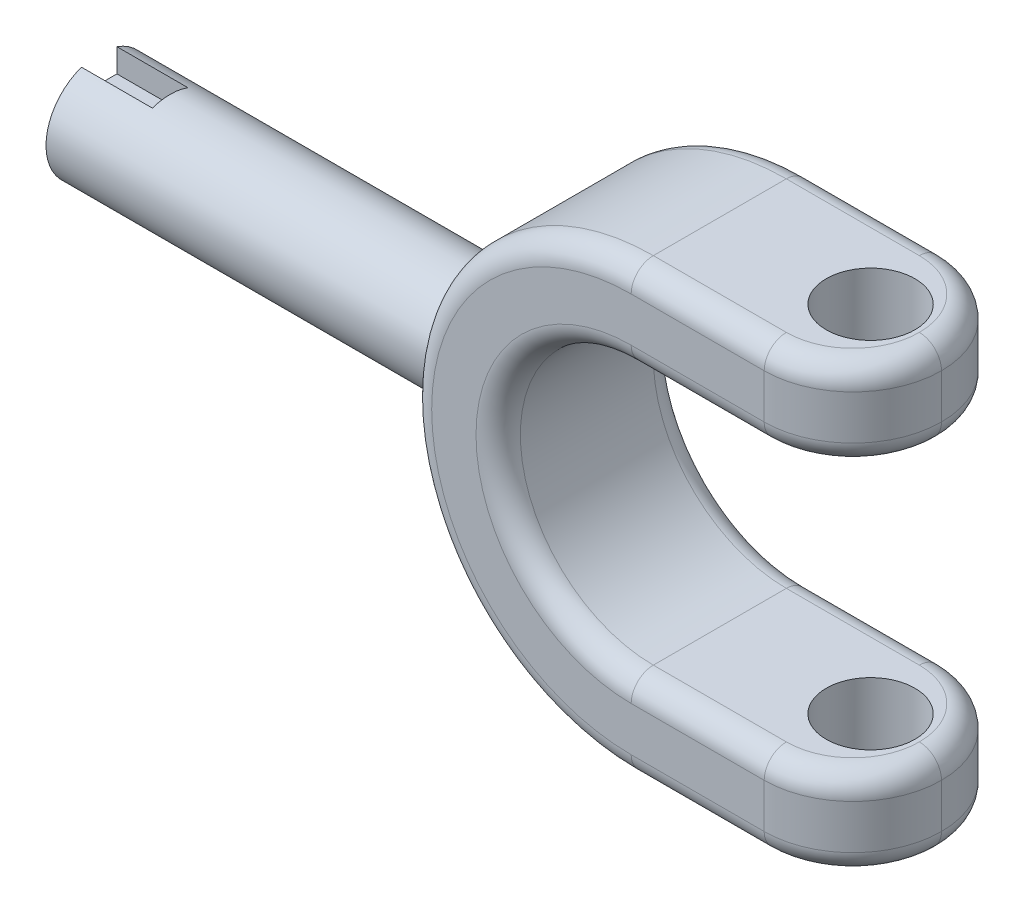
ISO-10303-21;
HEADER;
FILE_DESCRIPTION(('STEP AP214'),'2;1');
FILE_NAME('part.step','',(''),(''),'','','');
FILE_SCHEMA(('AUTOMOTIVE_DESIGN { 1 0 10303 214 1 1 1 1 }'));
ENDSEC;
DATA;
#1=APPLICATION_CONTEXT('core data for automotive mechanical design processes');
#2=APPLICATION_PROTOCOL_DEFINITION('international standard','automotive_design',2000,#1);
#3=PRODUCT_CONTEXT('',#1,'mechanical');
#4=PRODUCT('Part','Part','',(#3));
#5=PRODUCT_RELATED_PRODUCT_CATEGORY('part','',(#4));
#6=PRODUCT_DEFINITION_FORMATION('','',#4);
#7=PRODUCT_DEFINITION_CONTEXT('part definition',#1,'design');
#8=PRODUCT_DEFINITION('design','',#6,#7);
#9=PRODUCT_DEFINITION_SHAPE('','',#8);
#10=(LENGTH_UNIT() NAMED_UNIT(*) SI_UNIT(.MILLI.,.METRE.));
#11=(NAMED_UNIT(*) PLANE_ANGLE_UNIT() SI_UNIT($,.RADIAN.));
#12=(NAMED_UNIT(*) SI_UNIT($,.STERADIAN.) SOLID_ANGLE_UNIT());
#13=UNCERTAINTY_MEASURE_WITH_UNIT(LENGTH_MEASURE(1.E-05),#10,'distance_accuracy_value','');
#14=(GEOMETRIC_REPRESENTATION_CONTEXT(3) GLOBAL_UNCERTAINTY_ASSIGNED_CONTEXT((#13)) GLOBAL_UNIT_ASSIGNED_CONTEXT((#10,
#11,#12)) REPRESENTATION_CONTEXT('',''));
#15=CARTESIAN_POINT('',(0.,0.,0.));
#16=DIRECTION('',(0.,0.,1.));
#17=DIRECTION('',(1.,0.,0.));
#18=AXIS2_PLACEMENT_3D('',#15,#16,#17);
#19=CARTESIAN_POINT('',(0.,0.,20.));
#20=DIRECTION('',(0.,0.,-1.));
#21=DIRECTION('',(-1.,0.,0.));
#22=AXIS2_PLACEMENT_3D('',#19,#20,#21);
#23=CYLINDRICAL_SURFACE('',#22,25.);
#24=DIRECTION('',(0.,0.,-1.));
#25=VECTOR('',#24,1.);
#26=CARTESIAN_POINT('',(0.,25.,20.));
#27=LINE('',#26,#25);
#28=CARTESIAN_POINT('',(0.,25.,17.5));
#29=VERTEX_POINT('',#28);
#30=CARTESIAN_POINT('',(0.,25.,2.5));
#31=VERTEX_POINT('',#30);
#32=EDGE_CURVE('E302',#29,#31,#27,.T.);
#33=ORIENTED_EDGE('',*,*,#32,.T.);
#34=CARTESIAN_POINT('',(0.,0.,2.5));
#35=DIRECTION('',(0.,0.,1.));
#36=DIRECTION('',(1.,0.,0.));
#37=AXIS2_PLACEMENT_3D('',#34,#35,#36);
#38=CIRCLE('',#37,25.);
#39=CARTESIAN_POINT('',(0.,-25.,2.5));
#40=VERTEX_POINT('',#39);
#41=EDGE_CURVE('E11',#31,#40,#38,.T.);
#42=ORIENTED_EDGE('',*,*,#41,.T.);
#43=DIRECTION('',(0.,0.,-1.));
#44=VECTOR('',#43,1.);
#45=CARTESIAN_POINT('',(0.,-25.,20.));
#46=LINE('',#45,#44);
#47=CARTESIAN_POINT('',(0.,-25.,17.5));
#48=VERTEX_POINT('',#47);
#49=EDGE_CURVE('E300',#48,#40,#46,.T.);
#50=ORIENTED_EDGE('',*,*,#49,.F.);
#51=CARTESIAN_POINT('',(0.,0.,17.5));
#52=DIRECTION('',(0.,0.,1.));
#53=DIRECTION('',(1.,0.,0.));
#54=AXIS2_PLACEMENT_3D('',#51,#52,#53);
#55=CIRCLE('',#54,25.);
#56=EDGE_CURVE('E34',#48,#29,#55,.F.);
#57=ORIENTED_EDGE('',*,*,#56,.T.);
#58=EDGE_LOOP('',(#33,#42,#50,#57));
#59=FACE_BOUND('',#58,.T.);
#60=CARTESIAN_POINT('',(-25.,0.,16.));
#61=CARTESIAN_POINT('',(-25.0000026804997,0.166017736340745,16.0000045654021));
#62=CARTESIAN_POINT('',(-24.9983437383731,0.331984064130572,15.9931083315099));
#63=CARTESIAN_POINT('',(-24.9917601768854,0.662757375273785,15.9655909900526));
#64=CARTESIAN_POINT('',(-24.9868351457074,0.827564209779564,15.9449681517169));
#65=CARTESIAN_POINT('',(-24.9738504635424,1.15483168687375,15.8901535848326));
#66=CARTESIAN_POINT('',(-24.9657897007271,1.31729147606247,15.855957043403));
#67=CARTESIAN_POINT('',(-24.9467537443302,1.63872050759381,15.7742619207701));
#68=CARTESIAN_POINT('',(-24.9357774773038,1.79768844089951,15.7267584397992));
#69=CARTESIAN_POINT('',(-24.9112316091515,2.11072366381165,15.6189154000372));
#70=CARTESIAN_POINT('',(-24.897666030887,2.26479812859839,15.5585957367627));
#71=CARTESIAN_POINT('',(-24.8682925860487,2.56731972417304,15.4255126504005));
#72=CARTESIAN_POINT('',(-24.8524838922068,2.71576475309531,15.3527446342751));
#73=CARTESIAN_POINT('',(-24.8190587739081,3.00593509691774,15.1953429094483));
#74=CARTESIAN_POINT('',(-24.8014430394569,3.14766294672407,15.1107137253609));
#75=CARTESIAN_POINT('',(-24.7648612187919,3.42359889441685,14.930128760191));
#76=CARTESIAN_POINT('',(-24.7458946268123,3.55780414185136,14.8341687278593));
#77=CARTESIAN_POINT('',(-24.7067947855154,3.81996752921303,14.6298945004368));
#78=CARTESIAN_POINT('',(-24.6866473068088,3.94778319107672,14.5214001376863));
#79=CARTESIAN_POINT('',(-24.6460277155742,4.19391043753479,14.2940876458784));
#80=CARTESIAN_POINT('',(-24.6255554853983,4.31221847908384,14.1752657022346));
#81=CARTESIAN_POINT('',(-24.5848634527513,4.53846894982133,13.9281491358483));
#82=CARTESIAN_POINT('',(-24.5646435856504,4.64641408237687,13.7998569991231));
#83=CARTESIAN_POINT('',(-24.5250062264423,4.85128465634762,13.5345631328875));
#84=CARTESIAN_POINT('',(-24.5055890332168,4.94820601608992,13.3975582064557));
#85=CARTESIAN_POINT('',(-24.4678652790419,5.1315149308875,13.1139109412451));
#86=CARTESIAN_POINT('',(-24.4495768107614,5.21774615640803,12.9671650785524));
#87=CARTESIAN_POINT('',(-24.4149279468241,5.37754406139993,12.6666458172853));
#88=CARTESIAN_POINT('',(-24.3985682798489,5.45110595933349,12.5128697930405));
#89=CARTESIAN_POINT('',(-24.3682865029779,5.58492026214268,12.1994677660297));
#90=CARTESIAN_POINT('',(-24.354363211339,5.64517912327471,12.0398446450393));
#91=CARTESIAN_POINT('',(-24.3293636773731,5.75195806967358,11.7158528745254));
#92=CARTESIAN_POINT('',(-24.318288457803,5.79847322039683,11.5514825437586));
#93=CARTESIAN_POINT('',(-24.2902598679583,5.91523377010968,11.0591991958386));
#94=CARTESIAN_POINT('',(-24.2778811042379,5.96534620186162,10.7258747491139));
#95=CARTESIAN_POINT('',(-24.2697663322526,5.99819895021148,10.2235243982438));
#96=CARTESIAN_POINT('',(-24.2688053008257,6.00209048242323,10.055614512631));
#97=CARTESIAN_POINT('',(-24.2703574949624,5.99581246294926,9.72005333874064));
#98=CARTESIAN_POINT('',(-24.2728707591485,5.98564275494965,9.55240205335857));
#99=CARTESIAN_POINT('',(-24.285368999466,5.93483975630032,9.05923543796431));
#100=CARTESIAN_POINT('',(-24.3001939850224,5.87440247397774,8.73566109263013));
#101=CARTESIAN_POINT('',(-24.3412549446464,5.70184242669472,8.10355514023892));
#102=CARTESIAN_POINT('',(-24.3674916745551,5.58971623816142,7.79502453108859));
#103=CARTESIAN_POINT('',(-24.4286958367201,5.3158825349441,7.19818768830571));
#104=CARTESIAN_POINT('',(-24.4637429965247,5.15371899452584,6.91009875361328));
#105=CARTESIAN_POINT('',(-24.5385748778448,4.78473374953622,6.36478733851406));
#106=CARTESIAN_POINT('',(-24.5783603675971,4.57790479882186,6.10756987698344));
#107=CARTESIAN_POINT('',(-24.6594640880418,4.11902988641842,5.62421387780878));
#108=CARTESIAN_POINT('',(-24.7007951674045,3.86594129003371,5.39906607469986));
#109=CARTESIAN_POINT('',(-24.7793903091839,3.32511184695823,4.99423028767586));
#110=CARTESIAN_POINT('',(-24.8166542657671,3.03737009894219,4.81454348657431));
#111=CARTESIAN_POINT('',(-24.8830789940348,2.43405695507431,4.50540563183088));
#112=CARTESIAN_POINT('',(-24.9122154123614,2.11840557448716,4.37610510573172));
#113=CARTESIAN_POINT('',(-24.9589240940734,1.46899521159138,4.17266982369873));
#114=CARTESIAN_POINT('',(-24.9764983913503,1.13523942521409,4.09852536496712));
#115=CARTESIAN_POINT('',(-24.9978055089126,0.467574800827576,4.00899587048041));
#116=CARTESIAN_POINT('',(-25.0018564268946,0.133856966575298,3.99226019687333));
#117=CARTESIAN_POINT('',(-24.9965614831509,-0.531608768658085,4.01433355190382));
#118=CARTESIAN_POINT('',(-24.9872167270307,-0.863356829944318,4.05313799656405));
#119=CARTESIAN_POINT('',(-24.9563832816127,-1.51084514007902,4.18407388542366));
#120=CARTESIAN_POINT('',(-24.9350603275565,-1.8267410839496,4.27547795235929));
#121=CARTESIAN_POINT('',(-24.8826669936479,-2.4387066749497,4.50819665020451));
#122=CARTESIAN_POINT('',(-24.8515956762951,-2.73477441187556,4.64951608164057));
#123=CARTESIAN_POINT('',(-24.7823820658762,-3.30412273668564,4.98073217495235));
#124=CARTESIAN_POINT('',(-24.7441307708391,-3.57694246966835,5.17139762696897));
#125=CARTESIAN_POINT('',(-24.6649871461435,-4.08719914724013,5.59491766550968));
#126=CARTESIAN_POINT('',(-24.6240943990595,-4.32463047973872,5.82777893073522));
#127=CARTESIAN_POINT('',(-24.5431489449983,-4.76284500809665,6.33526712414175));
#128=CARTESIAN_POINT('',(-24.5031358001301,-4.96268414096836,6.61071541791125));
#129=CARTESIAN_POINT('',(-24.4295058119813,-5.31333575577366,7.19223567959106));
#130=CARTESIAN_POINT('',(-24.395888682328,-5.46415043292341,7.49830627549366));
#131=CARTESIAN_POINT('',(-24.353347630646,-5.64963439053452,7.97259368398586));
#132=CARTESIAN_POINT('',(-24.3405033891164,-5.70458710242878,8.13280695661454));
#133=CARTESIAN_POINT('',(-24.3177552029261,-5.80079732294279,8.45748202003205));
#134=CARTESIAN_POINT('',(-24.3078501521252,-5.84205998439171,8.62194218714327));
#135=CARTESIAN_POINT('',(-24.2912903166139,-5.91053741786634,8.95391790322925));
#136=CARTESIAN_POINT('',(-24.2846356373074,-5.93775173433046,9.12143355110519));
#137=CARTESIAN_POINT('',(-24.2747841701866,-5.97789965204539,9.45826646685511));
#138=CARTESIAN_POINT('',(-24.2715872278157,-5.99083389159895,9.62758365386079));
#139=CARTESIAN_POINT('',(-24.2687899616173,-6.00215499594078,9.96224873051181));
#140=CARTESIAN_POINT('',(-24.2690968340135,-6.00091722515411,10.1275832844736));
#141=CARTESIAN_POINT('',(-24.2730742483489,-5.9848087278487,10.4575435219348));
#142=CARTESIAN_POINT('',(-24.2767447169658,-5.96993829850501,10.6221692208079));
#143=CARTESIAN_POINT('',(-24.2873399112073,-5.92668661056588,10.9495546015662));
#144=CARTESIAN_POINT('',(-24.294265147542,-5.89830323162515,11.1123139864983));
#145=CARTESIAN_POINT('',(-24.3111608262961,-5.82827196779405,11.4347302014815));
#146=CARTESIAN_POINT('',(-24.3211301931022,-5.78662876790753,11.59438810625));
#147=CARTESIAN_POINT('',(-24.3437686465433,-5.69063662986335,11.9088075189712));
#148=CARTESIAN_POINT('',(-24.3564247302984,-5.63634876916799,12.0635886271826));
#149=CARTESIAN_POINT('',(-24.3840980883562,-5.51539707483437,12.3679533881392));
#150=CARTESIAN_POINT('',(-24.3991145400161,-5.44873755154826,12.5175388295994));
#151=CARTESIAN_POINT('',(-24.4310987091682,-5.30348427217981,12.8106621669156));
#152=CARTESIAN_POINT('',(-24.4480672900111,-5.22488523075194,12.9541973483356));
#153=CARTESIAN_POINT('',(-24.4834782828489,-5.05635243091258,13.2341911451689));
#154=CARTESIAN_POINT('',(-24.5019202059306,-4.96642242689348,13.3706520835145));
#155=CARTESIAN_POINT('',(-24.5402505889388,-4.77346921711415,13.6389503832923));
#156=CARTESIAN_POINT('',(-24.5601634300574,-4.67017903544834,13.7705923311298));
#157=CARTESIAN_POINT('',(-24.600458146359,-4.45304880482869,14.02470841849));
#158=CARTESIAN_POINT('',(-24.6208398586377,-4.33921237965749,14.1471856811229));
#159=CARTESIAN_POINT('',(-24.661530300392,-4.10164015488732,14.3822931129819));
#160=CARTESIAN_POINT('',(-24.6818389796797,-3.97789855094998,14.4949174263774));
#161=CARTESIAN_POINT('',(-24.7218081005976,-3.7214296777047,14.7094481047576));
#162=CARTESIAN_POINT('',(-24.7414687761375,-3.58870570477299,14.8113583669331));
#163=CARTESIAN_POINT('',(-24.7799327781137,-3.31280088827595,15.0054239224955));
#164=CARTESIAN_POINT('',(-24.7987162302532,-3.16948213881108,15.0973872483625));
#165=CARTESIAN_POINT('',(-24.8345280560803,-2.8754381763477,15.2688530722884));
#166=CARTESIAN_POINT('',(-24.8515570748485,-2.72471571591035,15.3483601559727));
#167=CARTESIAN_POINT('',(-24.883375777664,-2.41692354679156,15.4943122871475));
#168=CARTESIAN_POINT('',(-24.8981665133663,-2.25985686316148,15.5607634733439));
#169=CARTESIAN_POINT('',(-24.9250921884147,-1.94048744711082,15.6801042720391));
#170=CARTESIAN_POINT('',(-24.9372275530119,-1.77818555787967,15.7329960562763));
#171=CARTESIAN_POINT('',(-24.9647957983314,-1.35190448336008,15.8520251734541));
#172=CARTESIAN_POINT('',(-24.9779181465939,-1.08469226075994,15.9074241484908));
#173=CARTESIAN_POINT('',(-24.9955177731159,-0.544940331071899,15.9814066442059));
#174=CARTESIAN_POINT('',(-24.9999956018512,-0.272400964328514,15.9999925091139));
#175=CARTESIAN_POINT('',(-25.,0.,16.));
#176=B_SPLINE_CURVE_WITH_KNOTS('',3,(#60,#61,#62,#63,#64,#65,#66,#67,#68,#69,#70,#71,#72,#73,
#74,#75,#76,#77,#78,#79,#80,#81,#82,#83,#84,#85,#86,#87,#88,#89,#90,#91,#92,#93,#94,#95,#96,#97,
#98,#99,#100,#101,#102,#103,#104,#105,#106,#107,#108,#109,#110,#111,#112,#113,#114,#115,#116,
#117,#118,#119,#120,#121,#122,#123,#124,#125,#126,#127,#128,#129,#130,#131,#132,#133,#134,#135,
#136,#137,#138,#139,#140,#141,#142,#143,#144,#145,#146,#147,#148,#149,#150,#151,#152,#153,#154,
#155,#156,#157,#158,#159,#160,#161,#162,#163,#164,#165,#166,#167,#168,#169,#170,#171,#172,#173,
#174,#175),.UNSPECIFIED.,.T.,.F.,(4,2,2,2,2,2,2,2,2,2,2,2,2,2,2,2,2,2,2,2,2,2,2,2,2,2,2,2,2,2,2,
2,2,2,2,2,2,2,2,2,2,2,2,2,2,2,2,2,2,2,2,2,2,2,2,2,2,4),(0.,0.497813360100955,0.995689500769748,
1.49374233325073,1.99197879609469,2.4894473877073,2.98709992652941,3.48456314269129,
3.98221359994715,4.48820831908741,4.99439073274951,5.50044073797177,6.00667750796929,
6.5196119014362,7.03273945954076,7.5456174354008,8.05867933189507,9.06463756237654,
9.56800871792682,10.0713854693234,11.0548629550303,12.0384055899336,13.0311908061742,
14.0241372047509,15.0430966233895,16.0620825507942,17.0840897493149,18.1059171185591,
19.1035329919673,20.1010665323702,21.085126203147,22.069280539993,23.0698021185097,
24.0704821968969,25.0936623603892,26.1167967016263,26.6258643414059,27.1347401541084,
27.6436324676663,28.1525020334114,28.6479253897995,29.1433379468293,29.6388282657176,
30.1341437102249,30.6271145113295,31.1199138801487,31.6129320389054,32.105787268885,
32.6107272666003,33.1154944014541,33.6205595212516,34.1254402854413,34.6387770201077,
35.1519243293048,35.6648297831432,36.1776530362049,36.9945144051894,37.8113237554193),.UNSPECIFIED.);
#177=CARTESIAN_POINT('',(-25.,0.,16.));
#178=VERTEX_POINT('',#177);
#179=EDGE_CURVE('E308',#178,#178,#176,.T.);
#180=ORIENTED_EDGE('',*,*,#179,.F.);
#181=EDGE_LOOP('',(#180));
#182=FACE_BOUND('',#181,.T.);
#183=ADVANCED_FACE('F26',(#59,#182),#23,.T.);
#184=CARTESIAN_POINT('',(0.,0.,20.));
#185=DIRECTION('',(0.,0.,-1.));
#186=DIRECTION('',(-1.,0.,0.));
#187=AXIS2_PLACEMENT_3D('',#184,#185,#186);
#188=CYLINDRICAL_SURFACE('',#187,15.);
#189=DIRECTION('',(0.,0.,-1.));
#190=VECTOR('',#189,1.);
#191=CARTESIAN_POINT('',(0.,-15.,20.));
#192=LINE('',#191,#190);
#193=CARTESIAN_POINT('',(0.,-15.,17.5));
#194=VERTEX_POINT('',#193);
#195=CARTESIAN_POINT('',(0.,-15.,2.5));
#196=VERTEX_POINT('',#195);
#197=EDGE_CURVE('E297',#194,#196,#192,.T.);
#198=ORIENTED_EDGE('',*,*,#197,.T.);
#199=CARTESIAN_POINT('',(0.,0.,2.5));
#200=DIRECTION('',(0.,0.,1.));
#201=DIRECTION('',(1.,0.,0.));
#202=AXIS2_PLACEMENT_3D('',#199,#200,#201);
#203=CIRCLE('',#202,15.);
#204=CARTESIAN_POINT('',(0.,15.,2.5));
#205=VERTEX_POINT('',#204);
#206=EDGE_CURVE('E398',#196,#205,#203,.F.);
#207=ORIENTED_EDGE('',*,*,#206,.T.);
#208=DIRECTION('',(0.,0.,-1.));
#209=VECTOR('',#208,1.);
#210=CARTESIAN_POINT('',(0.,15.,20.));
#211=LINE('',#210,#209);
#212=CARTESIAN_POINT('',(0.,15.,17.5));
#213=VERTEX_POINT('',#212);
#214=EDGE_CURVE('E305',#213,#205,#211,.T.);
#215=ORIENTED_EDGE('',*,*,#214,.F.);
#216=CARTESIAN_POINT('',(0.,0.,17.5));
#217=DIRECTION('',(0.,0.,1.));
#218=DIRECTION('',(1.,0.,0.));
#219=AXIS2_PLACEMENT_3D('',#216,#217,#218);
#220=CIRCLE('',#219,15.);
#221=EDGE_CURVE('E396',#213,#194,#220,.T.);
#222=ORIENTED_EDGE('',*,*,#221,.T.);
#223=EDGE_LOOP('',(#198,#207,#215,#222));
#224=FACE_BOUND('',#223,.T.);
#225=ADVANCED_FACE('F28',(#224),#188,.F.);
#226=CARTESIAN_POINT('',(25.,15.,20.));
#227=DIRECTION('',(0.,1.,0.));
#228=DIRECTION('',(-1.,0.,0.));
#229=AXIS2_PLACEMENT_3D('',#226,#227,#228);
#230=PLANE('',#229);
#231=CARTESIAN_POINT('',(17.,15.,10.));
#232=DIRECTION('',(0.,1.,0.));
#233=DIRECTION('',(-1.,0.,0.));
#234=AXIS2_PLACEMENT_3D('',#231,#232,#233);
#235=CIRCLE('',#234,5.00000000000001);
#236=CARTESIAN_POINT('',(12.,15.,10.));
#237=VERTEX_POINT('',#236);
#238=EDGE_CURVE('E294',#237,#237,#235,.T.);
#239=ORIENTED_EDGE('',*,*,#238,.T.);
#240=EDGE_LOOP('',(#239));
#241=FACE_BOUND('',#240,.T.);
#242=ORIENTED_EDGE('',*,*,#214,.T.);
#243=DIRECTION('',(1.,0.,0.));
#244=VECTOR('',#243,1.);
#245=CARTESIAN_POINT('',(25.,15.,2.5));
#246=LINE('',#245,#244);
#247=CARTESIAN_POINT('',(15.,15.,2.5));
#248=VERTEX_POINT('',#247);
#249=EDGE_CURVE('E479',#205,#248,#246,.T.);
#250=ORIENTED_EDGE('',*,*,#249,.T.);
#251=CARTESIAN_POINT('',(15.,15.,10.));
#252=DIRECTION('',(0.,1.,0.));
#253=DIRECTION('',(-1.,0.,0.));
#254=AXIS2_PLACEMENT_3D('',#251,#252,#253);
#255=CIRCLE('',#254,7.5);
#256=CARTESIAN_POINT('',(22.5,15.,10.));
#257=VERTEX_POINT('',#256);
#258=EDGE_CURVE('E477',#248,#257,#255,.F.);
#259=ORIENTED_EDGE('',*,*,#258,.T.);
#260=CARTESIAN_POINT('',(15.,15.,10.));
#261=DIRECTION('',(0.,1.,0.));
#262=DIRECTION('',(-1.,0.,0.));
#263=AXIS2_PLACEMENT_3D('',#260,#261,#262);
#264=CIRCLE('',#263,7.5);
#265=CARTESIAN_POINT('',(15.,15.,17.5));
#266=VERTEX_POINT('',#265);
#267=EDGE_CURVE('E474',#257,#266,#264,.F.);
#268=ORIENTED_EDGE('',*,*,#267,.T.);
#269=DIRECTION('',(1.,0.,0.));
#270=VECTOR('',#269,1.);
#271=CARTESIAN_POINT('',(0.,15.,17.5));
#272=LINE('',#271,#270);
#273=EDGE_CURVE('E469',#266,#213,#272,.F.);
#274=ORIENTED_EDGE('',*,*,#273,.T.);
#275=EDGE_LOOP('',(#242,#250,#259,#268,#274));
#276=FACE_BOUND('',#275,.T.);
#277=ADVANCED_FACE('F352',(#241,#276),#230,.F.);
#278=CARTESIAN_POINT('',(25.,25.,20.));
#279=DIRECTION('',(0.,-1.,0.));
#280=DIRECTION('',(0.,0.,-1.));
#281=AXIS2_PLACEMENT_3D('',#278,#279,#280);
#282=PLANE('',#281);
#283=CARTESIAN_POINT('',(17.,25.,10.));
#284=DIRECTION('',(0.,1.,0.));
#285=DIRECTION('',(0.,0.,1.));
#286=AXIS2_PLACEMENT_3D('',#283,#284,#285);
#287=CIRCLE('',#286,5.00000000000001);
#288=CARTESIAN_POINT('',(17.,25.,15.));
#289=VERTEX_POINT('',#288);
#290=EDGE_CURVE('E287',#289,#289,#287,.T.);
#291=ORIENTED_EDGE('',*,*,#290,.F.);
#292=EDGE_LOOP('',(#291));
#293=FACE_BOUND('',#292,.T.);
#294=CARTESIAN_POINT('',(15.,25.,10.));
#295=DIRECTION('',(0.,-1.,0.));
#296=DIRECTION('',(0.,0.,-1.));
#297=AXIS2_PLACEMENT_3D('',#294,#295,#296);
#298=CIRCLE('',#297,7.5);
#299=CARTESIAN_POINT('',(22.5,25.,10.));
#300=VERTEX_POINT('',#299);
#301=CARTESIAN_POINT('',(15.,25.,2.5));
#302=VERTEX_POINT('',#301);
#303=EDGE_CURVE('E433',#300,#302,#298,.F.);
#304=ORIENTED_EDGE('',*,*,#303,.T.);
#305=DIRECTION('',(-1.,0.,0.));
#306=VECTOR('',#305,1.);
#307=CARTESIAN_POINT('',(25.,25.,2.5));
#308=LINE('',#307,#306);
#309=EDGE_CURVE('E379',#302,#31,#308,.T.);
#310=ORIENTED_EDGE('',*,*,#309,.T.);
#311=ORIENTED_EDGE('',*,*,#32,.F.);
#312=DIRECTION('',(-1.,0.,0.));
#313=VECTOR('',#312,1.);
#314=CARTESIAN_POINT('',(15.,25.,17.5));
#315=LINE('',#314,#313);
#316=CARTESIAN_POINT('',(15.,25.,17.5));
#317=VERTEX_POINT('',#316);
#318=EDGE_CURVE('E428',#29,#317,#315,.F.);
#319=ORIENTED_EDGE('',*,*,#318,.T.);
#320=CARTESIAN_POINT('',(15.,25.,10.));
#321=DIRECTION('',(0.,-1.,0.));
#322=DIRECTION('',(0.,0.,-1.));
#323=AXIS2_PLACEMENT_3D('',#320,#321,#322);
#324=CIRCLE('',#323,7.5);
#325=EDGE_CURVE('E430',#317,#300,#324,.F.);
#326=ORIENTED_EDGE('',*,*,#325,.T.);
#327=EDGE_LOOP('',(#304,#310,#311,#319,#326));
#328=FACE_BOUND('',#327,.T.);
#329=ADVANCED_FACE('F347',(#293,#328),#282,.F.);
#330=CARTESIAN_POINT('',(25.,-25.,20.));
#331=DIRECTION('',(0.,1.,0.));
#332=DIRECTION('',(0.,0.,1.));
#333=AXIS2_PLACEMENT_3D('',#330,#331,#332);
#334=PLANE('',#333);
#335=CARTESIAN_POINT('',(17.,-25.,10.));
#336=DIRECTION('',(0.,1.,0.));
#337=DIRECTION('',(0.,0.,1.));
#338=AXIS2_PLACEMENT_3D('',#335,#336,#337);
#339=CIRCLE('',#338,5.00000000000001);
#340=CARTESIAN_POINT('',(17.,-25.,15.));
#341=VERTEX_POINT('',#340);
#342=EDGE_CURVE('E290',#341,#341,#339,.T.);
#343=ORIENTED_EDGE('',*,*,#342,.T.);
#344=EDGE_LOOP('',(#343));
#345=FACE_BOUND('',#344,.T.);
#346=ORIENTED_EDGE('',*,*,#49,.T.);
#347=DIRECTION('',(1.,0.,0.));
#348=VECTOR('',#347,1.);
#349=CARTESIAN_POINT('',(25.,-25.,2.5));
#350=LINE('',#349,#348);
#351=CARTESIAN_POINT('',(15.,-25.,2.5));
#352=VERTEX_POINT('',#351);
#353=EDGE_CURVE('E49',#40,#352,#350,.T.);
#354=ORIENTED_EDGE('',*,*,#353,.T.);
#355=CARTESIAN_POINT('',(15.,-25.,10.));
#356=DIRECTION('',(0.,1.,0.));
#357=DIRECTION('',(0.,0.,1.));
#358=AXIS2_PLACEMENT_3D('',#355,#356,#357);
#359=CIRCLE('',#358,7.5);
#360=CARTESIAN_POINT('',(22.5,-25.,10.));
#361=VERTEX_POINT('',#360);
#362=EDGE_CURVE('E440',#352,#361,#359,.F.);
#363=ORIENTED_EDGE('',*,*,#362,.T.);
#364=CARTESIAN_POINT('',(15.,-25.,10.));
#365=DIRECTION('',(0.,1.,0.));
#366=DIRECTION('',(0.,0.,1.));
#367=AXIS2_PLACEMENT_3D('',#364,#365,#366);
#368=CIRCLE('',#367,7.5);
#369=CARTESIAN_POINT('',(15.,-25.,17.5));
#370=VERTEX_POINT('',#369);
#371=EDGE_CURVE('E438',#361,#370,#368,.F.);
#372=ORIENTED_EDGE('',*,*,#371,.T.);
#373=DIRECTION('',(1.,0.,0.));
#374=VECTOR('',#373,1.);
#375=CARTESIAN_POINT('',(0.,-25.,17.5));
#376=LINE('',#375,#374);
#377=EDGE_CURVE('E436',#370,#48,#376,.F.);
#378=ORIENTED_EDGE('',*,*,#377,.T.);
#379=EDGE_LOOP('',(#346,#354,#363,#372,#378));
#380=FACE_BOUND('',#379,.T.);
#381=ADVANCED_FACE('F344',(#345,#380),#334,.F.);
#382=CARTESIAN_POINT('',(25.,-15.,20.));
#383=DIRECTION('',(0.,-1.,0.));
#384=DIRECTION('',(1.,0.,0.));
#385=AXIS2_PLACEMENT_3D('',#382,#383,#384);
#386=PLANE('',#385);
#387=CARTESIAN_POINT('',(17.,-15.,10.));
#388=DIRECTION('',(0.,-1.,0.));
#389=DIRECTION('',(1.,0.,0.));
#390=AXIS2_PLACEMENT_3D('',#387,#388,#389);
#391=CIRCLE('',#390,5.00000000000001);
#392=CARTESIAN_POINT('',(22.,-15.,10.));
#393=VERTEX_POINT('',#392);
#394=EDGE_CURVE('E293',#393,#393,#391,.T.);
#395=ORIENTED_EDGE('',*,*,#394,.T.);
#396=EDGE_LOOP('',(#395));
#397=FACE_BOUND('',#396,.T.);
#398=CARTESIAN_POINT('',(15.,-15.,10.));
#399=DIRECTION('',(0.,-1.,0.));
#400=DIRECTION('',(1.,0.,0.));
#401=AXIS2_PLACEMENT_3D('',#398,#399,#400);
#402=CIRCLE('',#401,7.5);
#403=CARTESIAN_POINT('',(22.5,-15.,10.));
#404=VERTEX_POINT('',#403);
#405=CARTESIAN_POINT('',(15.,-15.,2.5));
#406=VERTEX_POINT('',#405);
#407=EDGE_CURVE('E404',#404,#406,#402,.F.);
#408=ORIENTED_EDGE('',*,*,#407,.T.);
#409=DIRECTION('',(-1.,0.,0.));
#410=VECTOR('',#409,1.);
#411=CARTESIAN_POINT('',(25.,-15.,2.5));
#412=LINE('',#411,#410);
#413=EDGE_CURVE('E406',#406,#196,#412,.T.);
#414=ORIENTED_EDGE('',*,*,#413,.T.);
#415=ORIENTED_EDGE('',*,*,#197,.F.);
#416=DIRECTION('',(-1.,0.,0.));
#417=VECTOR('',#416,1.);
#418=CARTESIAN_POINT('',(15.,-15.,17.5));
#419=LINE('',#418,#417);
#420=CARTESIAN_POINT('',(15.,-15.,17.5));
#421=VERTEX_POINT('',#420);
#422=EDGE_CURVE('E400',#194,#421,#419,.F.);
#423=ORIENTED_EDGE('',*,*,#422,.T.);
#424=CARTESIAN_POINT('',(15.,-15.,10.));
#425=DIRECTION('',(0.,-1.,0.));
#426=DIRECTION('',(1.,0.,0.));
#427=AXIS2_PLACEMENT_3D('',#424,#425,#426);
#428=CIRCLE('',#427,7.5);
#429=EDGE_CURVE('E402',#421,#404,#428,.F.);
#430=ORIENTED_EDGE('',*,*,#429,.T.);
#431=EDGE_LOOP('',(#408,#414,#415,#423,#430));
#432=FACE_BOUND('',#431,.T.);
#433=ADVANCED_FACE('F341',(#397,#432),#386,.F.);
#434=CARTESIAN_POINT('',(0.,0.,20.));
#435=DIRECTION('',(0.,0.,1.));
#436=DIRECTION('',(1.,0.,0.));
#437=AXIS2_PLACEMENT_3D('',#434,#435,#436);
#438=PLANE('',#437);
#439=DIRECTION('',(0.,1.,0.));
#440=VECTOR('',#439,1.);
#441=CARTESIAN_POINT('',(15.,-15.,20.));
#442=LINE('',#441,#440);
#443=CARTESIAN_POINT('',(15.,-22.5,20.));
#444=VERTEX_POINT('',#443);
#445=CARTESIAN_POINT('',(15.,-17.5,20.));
#446=VERTEX_POINT('',#445);
#447=EDGE_CURVE('E317',#444,#446,#442,.T.);
#448=ORIENTED_EDGE('',*,*,#447,.T.);
#449=DIRECTION('',(-1.,0.,0.));
#450=VECTOR('',#449,1.);
#451=CARTESIAN_POINT('',(0.,-17.5,20.));
#452=LINE('',#451,#450);
#453=CARTESIAN_POINT('',(0.,-17.5,20.));
#454=VERTEX_POINT('',#453);
#455=EDGE_CURVE('E426',#446,#454,#452,.T.);
#456=ORIENTED_EDGE('',*,*,#455,.T.);
#457=CARTESIAN_POINT('',(0.,0.,20.));
#458=DIRECTION('',(0.,0.,1.));
#459=DIRECTION('',(1.,0.,0.));
#460=AXIS2_PLACEMENT_3D('',#457,#458,#459);
#461=CIRCLE('',#460,17.5);
#462=CARTESIAN_POINT('',(0.,17.5,20.));
#463=VERTEX_POINT('',#462);
#464=EDGE_CURVE('E424',#454,#463,#461,.F.);
#465=ORIENTED_EDGE('',*,*,#464,.T.);
#466=DIRECTION('',(1.,0.,0.));
#467=VECTOR('',#466,1.);
#468=CARTESIAN_POINT('',(15.,17.5,20.));
#469=LINE('',#468,#467);
#470=CARTESIAN_POINT('',(15.,17.5,20.));
#471=VERTEX_POINT('',#470);
#472=EDGE_CURVE('E422',#463,#471,#469,.T.);
#473=ORIENTED_EDGE('',*,*,#472,.T.);
#474=DIRECTION('',(0.,1.,0.));
#475=VECTOR('',#474,1.);
#476=CARTESIAN_POINT('',(15.,25.,20.));
#477=LINE('',#476,#475);
#478=CARTESIAN_POINT('',(15.,22.5,20.));
#479=VERTEX_POINT('',#478);
#480=EDGE_CURVE('E467',#471,#479,#477,.T.);
#481=ORIENTED_EDGE('',*,*,#480,.T.);
#482=DIRECTION('',(-1.,0.,0.));
#483=VECTOR('',#482,1.);
#484=CARTESIAN_POINT('',(0.,22.5,20.));
#485=LINE('',#484,#483);
#486=CARTESIAN_POINT('',(0.,22.5,20.));
#487=VERTEX_POINT('',#486);
#488=EDGE_CURVE('E416',#479,#487,#485,.T.);
#489=ORIENTED_EDGE('',*,*,#488,.T.);
#490=CARTESIAN_POINT('',(0.,0.,20.));
#491=DIRECTION('',(0.,0.,1.));
#492=DIRECTION('',(1.,0.,0.));
#493=AXIS2_PLACEMENT_3D('',#490,#491,#492);
#494=CIRCLE('',#493,22.5);
#495=CARTESIAN_POINT('',(0.,-22.5,20.));
#496=VERTEX_POINT('',#495);
#497=EDGE_CURVE('E418',#487,#496,#494,.T.);
#498=ORIENTED_EDGE('',*,*,#497,.T.);
#499=DIRECTION('',(1.,0.,0.));
#500=VECTOR('',#499,1.);
#501=CARTESIAN_POINT('',(15.,-22.5,20.));
#502=LINE('',#501,#500);
#503=EDGE_CURVE('E420',#496,#444,#502,.T.);
#504=ORIENTED_EDGE('',*,*,#503,.T.);
#505=EDGE_LOOP('',(#448,#456,#465,#473,#481,#489,#498,#504));
#506=FACE_BOUND('',#505,.T.);
#507=ADVANCED_FACE('F337',(#506),#438,.T.);
#508=CARTESIAN_POINT('',(0.,0.,0.));
#509=DIRECTION('',(0.,0.,1.));
#510=DIRECTION('',(1.,0.,0.));
#511=AXIS2_PLACEMENT_3D('',#508,#509,#510);
#512=PLANE('',#511);
#513=DIRECTION('',(0.,1.,0.));
#514=VECTOR('',#513,1.);
#515=CARTESIAN_POINT('',(15.,0.,0.));
#516=LINE('',#515,#514);
#517=CARTESIAN_POINT('',(15.,22.5,0.));
#518=VERTEX_POINT('',#517);
#519=CARTESIAN_POINT('',(15.,17.5,0.));
#520=VERTEX_POINT('',#519);
#521=EDGE_CURVE('E466',#518,#520,#516,.F.);
#522=ORIENTED_EDGE('',*,*,#521,.T.);
#523=DIRECTION('',(1.,0.,0.));
#524=VECTOR('',#523,1.);
#525=CARTESIAN_POINT('',(0.,17.5,0.));
#526=LINE('',#525,#524);
#527=CARTESIAN_POINT('',(0.,17.5,0.));
#528=VERTEX_POINT('',#527);
#529=EDGE_CURVE('E394',#520,#528,#526,.F.);
#530=ORIENTED_EDGE('',*,*,#529,.T.);
#531=CARTESIAN_POINT('',(0.,0.,0.));
#532=DIRECTION('',(0.,0.,1.));
#533=DIRECTION('',(1.,0.,0.));
#534=AXIS2_PLACEMENT_3D('',#531,#532,#533);
#535=CIRCLE('',#534,17.5);
#536=CARTESIAN_POINT('',(0.,-17.5,0.));
#537=VERTEX_POINT('',#536);
#538=EDGE_CURVE('E387',#528,#537,#535,.T.);
#539=ORIENTED_EDGE('',*,*,#538,.T.);
#540=DIRECTION('',(-1.,0.,0.));
#541=VECTOR('',#540,1.);
#542=CARTESIAN_POINT('',(0.,-17.5,0.));
#543=LINE('',#542,#541);
#544=CARTESIAN_POINT('',(15.,-17.5,0.));
#545=VERTEX_POINT('',#544);
#546=EDGE_CURVE('E384',#537,#545,#543,.F.);
#547=ORIENTED_EDGE('',*,*,#546,.T.);
#548=DIRECTION('',(0.,1.,0.));
#549=VECTOR('',#548,1.);
#550=CARTESIAN_POINT('',(15.,0.,0.));
#551=LINE('',#550,#549);
#552=CARTESIAN_POINT('',(15.,-22.5,0.));
#553=VERTEX_POINT('',#552);
#554=EDGE_CURVE('E462',#545,#553,#551,.F.);
#555=ORIENTED_EDGE('',*,*,#554,.T.);
#556=DIRECTION('',(1.,0.,0.));
#557=VECTOR('',#556,1.);
#558=CARTESIAN_POINT('',(0.,-22.5,0.));
#559=LINE('',#558,#557);
#560=CARTESIAN_POINT('',(0.,-22.5,0.));
#561=VERTEX_POINT('',#560);
#562=EDGE_CURVE('E385',#553,#561,#559,.F.);
#563=ORIENTED_EDGE('',*,*,#562,.T.);
#564=CARTESIAN_POINT('',(0.,0.,0.));
#565=DIRECTION('',(0.,0.,1.));
#566=DIRECTION('',(1.,0.,0.));
#567=AXIS2_PLACEMENT_3D('',#564,#565,#566);
#568=CIRCLE('',#567,22.5);
#569=CARTESIAN_POINT('',(0.,22.5,0.));
#570=VERTEX_POINT('',#569);
#571=EDGE_CURVE('E389',#561,#570,#568,.F.);
#572=ORIENTED_EDGE('',*,*,#571,.T.);
#573=DIRECTION('',(-1.,0.,0.));
#574=VECTOR('',#573,1.);
#575=CARTESIAN_POINT('',(0.,22.5,0.));
#576=LINE('',#575,#574);
#577=EDGE_CURVE('E380',#570,#518,#576,.F.);
#578=ORIENTED_EDGE('',*,*,#577,.T.);
#579=EDGE_LOOP('',(#522,#530,#539,#547,#555,#563,#572,#578));
#580=FACE_BOUND('',#579,.T.);
#581=ADVANCED_FACE('F334',(#580),#512,.F.);
#582=CARTESIAN_POINT('',(17.,-25.,10.));
#583=DIRECTION('',(0.,1.,0.));
#584=DIRECTION('',(0.,0.,1.));
#585=AXIS2_PLACEMENT_3D('',#582,#583,#584);
#586=CYLINDRICAL_SURFACE('',#585,5.00000000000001);
#587=ORIENTED_EDGE('',*,*,#342,.F.);
#588=EDGE_LOOP('',(#587));
#589=FACE_BOUND('',#588,.T.);
#590=ORIENTED_EDGE('',*,*,#394,.F.);
#591=EDGE_LOOP('',(#590));
#592=FACE_BOUND('',#591,.T.);
#593=ADVANCED_FACE('F332',(#589,#592),#586,.F.);
#594=ORIENTED_EDGE('',*,*,#290,.T.);
#595=EDGE_LOOP('',(#594));
#596=FACE_BOUND('',#595,.T.);
#597=ORIENTED_EDGE('',*,*,#238,.F.);
#598=EDGE_LOOP('',(#597));
#599=FACE_BOUND('',#598,.T.);
#600=ADVANCED_FACE('F327',(#596,#599),#586,.F.);
#601=CARTESIAN_POINT('',(25.001,0.,10.));
#602=DIRECTION('',(-1.,0.,0.));
#603=DIRECTION('',(0.,0.,1.));
#604=AXIS2_PLACEMENT_3D('',#601,#602,#603);
#605=CYLINDRICAL_SURFACE('',#604,6.);
#606=CARTESIAN_POINT('',(-62.,0.,10.));
#607=DIRECTION('',(-1.,0.,0.));
#608=DIRECTION('',(0.,0.,1.));
#609=AXIS2_PLACEMENT_3D('',#606,#607,#608);
#610=CIRCLE('',#609,6.);
#611=CARTESIAN_POINT('',(-62.,5.65685424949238,12.));
#612=VERTEX_POINT('',#611);
#613=CARTESIAN_POINT('',(-62.,5.65685424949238,8.00000000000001));
#614=VERTEX_POINT('',#613);
#615=EDGE_CURVE('E207',#612,#614,#610,.T.);
#616=ORIENTED_EDGE('',*,*,#615,.F.);
#617=DIRECTION('',(-1.,0.,0.));
#618=VECTOR('',#617,1.);
#619=CARTESIAN_POINT('',(-62.,5.65685424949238,12.));
#620=LINE('',#619,#618);
#621=CARTESIAN_POINT('',(-70.,5.65685424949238,12.));
#622=VERTEX_POINT('',#621);
#623=EDGE_CURVE('E218',#612,#622,#620,.T.);
#624=ORIENTED_EDGE('',*,*,#623,.T.);
#625=CARTESIAN_POINT('',(-70.,0.,10.));
#626=DIRECTION('',(1.,0.,0.));
#627=DIRECTION('',(0.,0.,-1.));
#628=AXIS2_PLACEMENT_3D('',#625,#626,#627);
#629=CIRCLE('',#628,6.);
#630=CARTESIAN_POINT('',(-70.,5.65685424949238,8.00000000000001));
#631=VERTEX_POINT('',#630);
#632=EDGE_CURVE('E285',#622,#631,#629,.T.);
#633=ORIENTED_EDGE('',*,*,#632,.T.);
#634=DIRECTION('',(-1.,0.,0.));
#635=VECTOR('',#634,1.);
#636=CARTESIAN_POINT('',(-62.,5.65685424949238,8.00000000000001));
#637=LINE('',#636,#635);
#638=EDGE_CURVE('E41',#614,#631,#637,.T.);
#639=ORIENTED_EDGE('',*,*,#638,.F.);
#640=EDGE_LOOP('',(#616,#624,#633,#639));
#641=FACE_BOUND('',#640,.T.);
#642=ORIENTED_EDGE('',*,*,#179,.T.);
#643=EDGE_LOOP('',(#642));
#644=FACE_BOUND('',#643,.T.);
#645=ADVANCED_FACE('F322',(#641,#644),#605,.T.);
#646=CARTESIAN_POINT('',(-70.,0.,10.));
#647=DIRECTION('',(1.,0.,0.));
#648=DIRECTION('',(0.,0.,-1.));
#649=AXIS2_PLACEMENT_3D('',#646,#647,#648);
#650=PLANE('',#649);
#651=ORIENTED_EDGE('',*,*,#632,.F.);
#652=DIRECTION('',(0.,1.,0.));
#653=VECTOR('',#652,1.);
#654=CARTESIAN_POINT('',(-70.,5.65685424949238,12.));
#655=LINE('',#654,#653);
#656=CARTESIAN_POINT('',(-70.,3.,12.));
#657=VERTEX_POINT('',#656);
#658=EDGE_CURVE('E205',#657,#622,#655,.T.);
#659=ORIENTED_EDGE('',*,*,#658,.F.);
#660=DIRECTION('',(0.,0.,1.));
#661=VECTOR('',#660,1.);
#662=CARTESIAN_POINT('',(-70.,3.,8.00000000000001));
#663=LINE('',#662,#661);
#664=CARTESIAN_POINT('',(-70.,3.,8.00000000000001));
#665=VERTEX_POINT('',#664);
#666=EDGE_CURVE('E191',#665,#657,#663,.T.);
#667=ORIENTED_EDGE('',*,*,#666,.F.);
#668=DIRECTION('',(0.,-1.,0.));
#669=VECTOR('',#668,1.);
#670=CARTESIAN_POINT('',(-70.,5.65685424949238,8.00000000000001));
#671=LINE('',#670,#669);
#672=EDGE_CURVE('E198',#631,#665,#671,.T.);
#673=ORIENTED_EDGE('',*,*,#672,.F.);
#674=EDGE_LOOP('',(#651,#659,#667,#673));
#675=FACE_BOUND('',#674,.T.);
#676=ADVANCED_FACE('F204',(#675),#650,.F.);
#677=CARTESIAN_POINT('',(15.,25.,10.));
#678=DIRECTION('',(0.,1.,0.));
#679=DIRECTION('',(0.,0.,1.));
#680=AXIS2_PLACEMENT_3D('',#677,#678,#679);
#681=CYLINDRICAL_SURFACE('',#680,10.);
#682=DIRECTION('',(0.,1.,0.));
#683=VECTOR('',#682,1.);
#684=CARTESIAN_POINT('',(25.,25.,10.));
#685=LINE('',#684,#683);
#686=CARTESIAN_POINT('',(25.,17.5,10.));
#687=VERTEX_POINT('',#686);
#688=CARTESIAN_POINT('',(25.,22.5,10.));
#689=VERTEX_POINT('',#688);
#690=EDGE_CURVE('E282',#687,#689,#685,.T.);
#691=ORIENTED_EDGE('',*,*,#690,.F.);
#692=CARTESIAN_POINT('',(15.,17.5,10.));
#693=DIRECTION('',(0.,1.,0.));
#694=DIRECTION('',(-1.,0.,0.));
#695=AXIS2_PLACEMENT_3D('',#692,#693,#694);
#696=CIRCLE('',#695,10.);
#697=EDGE_CURVE('E489',#687,#520,#696,.T.);
#698=ORIENTED_EDGE('',*,*,#697,.T.);
#699=ORIENTED_EDGE('',*,*,#521,.F.);
#700=CARTESIAN_POINT('',(15.,22.5,10.));
#701=DIRECTION('',(0.,-1.,0.));
#702=DIRECTION('',(0.,0.,-1.));
#703=AXIS2_PLACEMENT_3D('',#700,#701,#702);
#704=CIRCLE('',#703,10.);
#705=EDGE_CURVE('E487',#518,#689,#704,.T.);
#706=ORIENTED_EDGE('',*,*,#705,.T.);
#707=EDGE_LOOP('',(#691,#698,#699,#706));
#708=FACE_BOUND('',#707,.T.);
#709=ADVANCED_FACE('F493',(#708),#681,.T.);
#710=CARTESIAN_POINT('',(15.,0.,10.));
#711=DIRECTION('',(0.,-1.,0.));
#712=DIRECTION('',(0.,0.,-1.));
#713=AXIS2_PLACEMENT_3D('',#710,#711,#712);
#714=CYLINDRICAL_SURFACE('',#713,10.);
#715=ORIENTED_EDGE('',*,*,#480,.F.);
#716=CARTESIAN_POINT('',(15.,17.5,10.));
#717=DIRECTION('',(0.,1.,0.));
#718=DIRECTION('',(-1.,0.,0.));
#719=AXIS2_PLACEMENT_3D('',#716,#717,#718);
#720=CIRCLE('',#719,10.);
#721=EDGE_CURVE('E484',#471,#687,#720,.T.);
#722=ORIENTED_EDGE('',*,*,#721,.T.);
#723=ORIENTED_EDGE('',*,*,#690,.T.);
#724=CARTESIAN_POINT('',(15.,22.5,10.));
#725=DIRECTION('',(0.,-1.,0.));
#726=DIRECTION('',(0.,0.,-1.));
#727=AXIS2_PLACEMENT_3D('',#724,#725,#726);
#728=CIRCLE('',#727,10.);
#729=EDGE_CURVE('E481',#689,#479,#728,.T.);
#730=ORIENTED_EDGE('',*,*,#729,.T.);
#731=EDGE_LOOP('',(#715,#722,#723,#730));
#732=FACE_BOUND('',#731,.T.);
#733=ADVANCED_FACE('F548',(#732),#714,.T.);
#734=CARTESIAN_POINT('',(15.,-15.,10.));
#735=DIRECTION('',(0.,1.,0.));
#736=DIRECTION('',(0.,0.,1.));
#737=AXIS2_PLACEMENT_3D('',#734,#735,#736);
#738=CYLINDRICAL_SURFACE('',#737,10.);
#739=ORIENTED_EDGE('',*,*,#554,.F.);
#740=CARTESIAN_POINT('',(15.,-17.5,10.));
#741=DIRECTION('',(0.,-1.,0.));
#742=DIRECTION('',(1.,0.,0.));
#743=AXIS2_PLACEMENT_3D('',#740,#741,#742);
#744=CIRCLE('',#743,10.);
#745=CARTESIAN_POINT('',(25.,-17.5,10.));
#746=VERTEX_POINT('',#745);
#747=EDGE_CURVE('E410',#545,#746,#744,.T.);
#748=ORIENTED_EDGE('',*,*,#747,.T.);
#749=DIRECTION('',(0.,1.,0.));
#750=VECTOR('',#749,1.);
#751=CARTESIAN_POINT('',(25.,-15.,10.));
#752=LINE('',#751,#750);
#753=CARTESIAN_POINT('',(25.,-22.5,10.));
#754=VERTEX_POINT('',#753);
#755=EDGE_CURVE('E279',#754,#746,#752,.T.);
#756=ORIENTED_EDGE('',*,*,#755,.F.);
#757=CARTESIAN_POINT('',(15.,-22.5,10.));
#758=DIRECTION('',(0.,1.,0.));
#759=DIRECTION('',(0.,0.,1.));
#760=AXIS2_PLACEMENT_3D('',#757,#758,#759);
#761=CIRCLE('',#760,10.);
#762=EDGE_CURVE('E408',#754,#553,#761,.T.);
#763=ORIENTED_EDGE('',*,*,#762,.T.);
#764=EDGE_LOOP('',(#739,#748,#756,#763));
#765=FACE_BOUND('',#764,.T.);
#766=ADVANCED_FACE('F524',(#765),#738,.T.);
#767=CARTESIAN_POINT('',(15.,0.,10.));
#768=DIRECTION('',(0.,-1.,0.));
#769=DIRECTION('',(0.,0.,-1.));
#770=AXIS2_PLACEMENT_3D('',#767,#768,#769);
#771=CYLINDRICAL_SURFACE('',#770,10.);
#772=ORIENTED_EDGE('',*,*,#755,.T.);
#773=CARTESIAN_POINT('',(15.,-17.5,10.));
#774=DIRECTION('',(0.,-1.,0.));
#775=DIRECTION('',(1.,0.,0.));
#776=AXIS2_PLACEMENT_3D('',#773,#774,#775);
#777=CIRCLE('',#776,10.);
#778=EDGE_CURVE('E414',#746,#446,#777,.T.);
#779=ORIENTED_EDGE('',*,*,#778,.T.);
#780=ORIENTED_EDGE('',*,*,#447,.F.);
#781=CARTESIAN_POINT('',(15.,-22.5,10.));
#782=DIRECTION('',(0.,1.,0.));
#783=DIRECTION('',(0.,0.,1.));
#784=AXIS2_PLACEMENT_3D('',#781,#782,#783);
#785=CIRCLE('',#784,10.);
#786=EDGE_CURVE('E412',#444,#754,#785,.T.);
#787=ORIENTED_EDGE('',*,*,#786,.T.);
#788=EDGE_LOOP('',(#772,#779,#780,#787));
#789=FACE_BOUND('',#788,.T.);
#790=ADVANCED_FACE('F526',(#789),#771,.T.);
#791=CARTESIAN_POINT('',(15.,-17.5,10.));
#792=DIRECTION('',(0.,-1.,0.));
#793=DIRECTION('',(1.,0.,0.));
#794=AXIS2_PLACEMENT_3D('',#791,#792,#793);
#795=TOROIDAL_SURFACE('',#794,7.5,2.5);
#796=CARTESIAN_POINT('',(22.5,-17.5,10.));
#797=DIRECTION('',(0.,0.,1.));
#798=DIRECTION('',(1.,0.,0.));
#799=AXIS2_PLACEMENT_3D('',#796,#797,#798);
#800=CIRCLE('',#799,2.5);
#801=EDGE_CURVE('E273',#746,#404,#800,.T.);
#802=ORIENTED_EDGE('',*,*,#801,.F.);
#803=ORIENTED_EDGE('',*,*,#747,.F.);
#804=CARTESIAN_POINT('',(15.,-17.5,2.5));
#805=DIRECTION('',(-1.,0.,0.));
#806=DIRECTION('',(0.,0.,1.));
#807=AXIS2_PLACEMENT_3D('',#804,#805,#806);
#808=CIRCLE('',#807,2.5);
#809=EDGE_CURVE('E276',#406,#545,#808,.T.);
#810=ORIENTED_EDGE('',*,*,#809,.F.);
#811=ORIENTED_EDGE('',*,*,#407,.F.);
#812=EDGE_LOOP('',(#802,#803,#810,#811));
#813=FACE_BOUND('',#812,.T.);
#814=ADVANCED_FACE('F521',(#813),#795,.T.);
#815=CARTESIAN_POINT('',(25.,-17.5,2.5));
#816=DIRECTION('',(-1.,0.,0.));
#817=DIRECTION('',(0.,-1.,0.));
#818=AXIS2_PLACEMENT_3D('',#815,#816,#817);
#819=CYLINDRICAL_SURFACE('',#818,2.5);
#820=ORIENTED_EDGE('',*,*,#809,.T.);
#821=ORIENTED_EDGE('',*,*,#546,.F.);
#822=CARTESIAN_POINT('',(0.,-17.5,2.5));
#823=DIRECTION('',(-1.,0.,0.));
#824=DIRECTION('',(0.,-1.,0.));
#825=AXIS2_PLACEMENT_3D('',#822,#823,#824);
#826=CIRCLE('',#825,2.5);
#827=EDGE_CURVE('E270',#196,#537,#826,.T.);
#828=ORIENTED_EDGE('',*,*,#827,.F.);
#829=ORIENTED_EDGE('',*,*,#413,.F.);
#830=EDGE_LOOP('',(#820,#821,#828,#829));
#831=FACE_BOUND('',#830,.T.);
#832=ADVANCED_FACE('F515',(#831),#819,.T.);
#833=CARTESIAN_POINT('',(15.,-17.5,10.));
#834=DIRECTION('',(0.,-1.,0.));
#835=DIRECTION('',(1.,0.,0.));
#836=AXIS2_PLACEMENT_3D('',#833,#834,#835);
#837=TOROIDAL_SURFACE('',#836,7.5,2.5);
#838=ORIENTED_EDGE('',*,*,#801,.T.);
#839=ORIENTED_EDGE('',*,*,#429,.F.);
#840=CARTESIAN_POINT('',(15.,-17.5,17.5));
#841=DIRECTION('',(-1.,0.,0.));
#842=DIRECTION('',(0.,0.,1.));
#843=AXIS2_PLACEMENT_3D('',#840,#841,#842);
#844=CIRCLE('',#843,2.5);
#845=EDGE_CURVE('E267',#446,#421,#844,.T.);
#846=ORIENTED_EDGE('',*,*,#845,.F.);
#847=ORIENTED_EDGE('',*,*,#778,.F.);
#848=EDGE_LOOP('',(#838,#839,#846,#847));
#849=FACE_BOUND('',#848,.T.);
#850=ADVANCED_FACE('F534',(#849),#837,.T.);
#851=CARTESIAN_POINT('',(0.,0.,2.5));
#852=DIRECTION('',(0.,0.,1.));
#853=DIRECTION('',(1.,0.,0.));
#854=AXIS2_PLACEMENT_3D('',#851,#852,#853);
#855=TOROIDAL_SURFACE('',#854,17.5,2.5);
#856=ORIENTED_EDGE('',*,*,#827,.T.);
#857=ORIENTED_EDGE('',*,*,#538,.F.);
#858=CARTESIAN_POINT('',(0.,17.5,2.5));
#859=DIRECTION('',(1.,0.,0.));
#860=DIRECTION('',(0.,0.,-1.));
#861=AXIS2_PLACEMENT_3D('',#858,#859,#860);
#862=CIRCLE('',#861,2.5);
#863=EDGE_CURVE('E264',#205,#528,#862,.T.);
#864=ORIENTED_EDGE('',*,*,#863,.F.);
#865=ORIENTED_EDGE('',*,*,#206,.F.);
#866=EDGE_LOOP('',(#856,#857,#864,#865));
#867=FACE_BOUND('',#866,.T.);
#868=ADVANCED_FACE('F512',(#867),#855,.T.);
#869=CARTESIAN_POINT('',(0.,-17.5,17.5));
#870=DIRECTION('',(1.,0.,0.));
#871=DIRECTION('',(0.,1.,0.));
#872=AXIS2_PLACEMENT_3D('',#869,#870,#871);
#873=CYLINDRICAL_SURFACE('',#872,2.5);
#874=ORIENTED_EDGE('',*,*,#845,.T.);
#875=ORIENTED_EDGE('',*,*,#422,.F.);
#876=CARTESIAN_POINT('',(0.,-17.5,17.5));
#877=DIRECTION('',(-1.,0.,0.));
#878=DIRECTION('',(0.,-1.,0.));
#879=AXIS2_PLACEMENT_3D('',#876,#877,#878);
#880=CIRCLE('',#879,2.5);
#881=EDGE_CURVE('E261',#454,#194,#880,.T.);
#882=ORIENTED_EDGE('',*,*,#881,.F.);
#883=ORIENTED_EDGE('',*,*,#455,.F.);
#884=EDGE_LOOP('',(#874,#875,#882,#883));
#885=FACE_BOUND('',#884,.T.);
#886=ADVANCED_FACE('F537',(#885),#873,.T.);
#887=CARTESIAN_POINT('',(25.,17.5,2.5));
#888=DIRECTION('',(1.,0.,0.));
#889=DIRECTION('',(0.,1.,0.));
#890=AXIS2_PLACEMENT_3D('',#887,#888,#889);
#891=CYLINDRICAL_SURFACE('',#890,2.5);
#892=ORIENTED_EDGE('',*,*,#863,.T.);
#893=ORIENTED_EDGE('',*,*,#529,.F.);
#894=CARTESIAN_POINT('',(15.,17.5,2.5));
#895=DIRECTION('',(1.,0.,0.));
#896=DIRECTION('',(0.,1.,0.));
#897=AXIS2_PLACEMENT_3D('',#894,#895,#896);
#898=CIRCLE('',#897,2.5);
#899=EDGE_CURVE('E258',#248,#520,#898,.T.);
#900=ORIENTED_EDGE('',*,*,#899,.F.);
#901=ORIENTED_EDGE('',*,*,#249,.F.);
#902=EDGE_LOOP('',(#892,#893,#900,#901));
#903=FACE_BOUND('',#902,.T.);
#904=ADVANCED_FACE('F500',(#903),#891,.T.);
#905=CARTESIAN_POINT('',(0.,0.,17.5));
#906=DIRECTION('',(0.,0.,1.));
#907=DIRECTION('',(1.,0.,0.));
#908=AXIS2_PLACEMENT_3D('',#905,#906,#907);
#909=TOROIDAL_SURFACE('',#908,17.5,2.5);
#910=ORIENTED_EDGE('',*,*,#881,.T.);
#911=ORIENTED_EDGE('',*,*,#221,.F.);
#912=CARTESIAN_POINT('',(0.,17.5,17.5));
#913=DIRECTION('',(1.,0.,0.));
#914=DIRECTION('',(0.,1.,0.));
#915=AXIS2_PLACEMENT_3D('',#912,#913,#914);
#916=CIRCLE('',#915,2.5);
#917=EDGE_CURVE('E255',#463,#213,#916,.T.);
#918=ORIENTED_EDGE('',*,*,#917,.F.);
#919=ORIENTED_EDGE('',*,*,#464,.F.);
#920=EDGE_LOOP('',(#910,#911,#918,#919));
#921=FACE_BOUND('',#920,.T.);
#922=ADVANCED_FACE('F541',(#921),#909,.T.);
#923=CARTESIAN_POINT('',(15.,17.5,10.));
#924=DIRECTION('',(0.,1.,0.));
#925=DIRECTION('',(-1.,0.,0.));
#926=AXIS2_PLACEMENT_3D('',#923,#924,#925);
#927=TOROIDAL_SURFACE('',#926,7.5,2.5);
#928=ORIENTED_EDGE('',*,*,#899,.T.);
#929=ORIENTED_EDGE('',*,*,#697,.F.);
#930=CARTESIAN_POINT('',(22.5,17.5,10.));
#931=DIRECTION('',(0.,0.,1.));
#932=DIRECTION('',(1.,0.,0.));
#933=AXIS2_PLACEMENT_3D('',#930,#931,#932);
#934=CIRCLE('',#933,2.5);
#935=EDGE_CURVE('E253',#257,#687,#934,.T.);
#936=ORIENTED_EDGE('',*,*,#935,.F.);
#937=ORIENTED_EDGE('',*,*,#258,.F.);
#938=EDGE_LOOP('',(#928,#929,#936,#937));
#939=FACE_BOUND('',#938,.T.);
#940=ADVANCED_FACE('F504',(#939),#927,.T.);
#941=CARTESIAN_POINT('',(0.,17.5,17.5));
#942=DIRECTION('',(-1.,0.,0.));
#943=DIRECTION('',(0.,-1.,0.));
#944=AXIS2_PLACEMENT_3D('',#941,#942,#943);
#945=CYLINDRICAL_SURFACE('',#944,2.5);
#946=ORIENTED_EDGE('',*,*,#917,.T.);
#947=ORIENTED_EDGE('',*,*,#273,.F.);
#948=CARTESIAN_POINT('',(15.,17.5,17.5));
#949=DIRECTION('',(1.,0.,0.));
#950=DIRECTION('',(0.,0.,-1.));
#951=AXIS2_PLACEMENT_3D('',#948,#949,#950);
#952=CIRCLE('',#951,2.5);
#953=EDGE_CURVE('E251',#471,#266,#952,.T.);
#954=ORIENTED_EDGE('',*,*,#953,.F.);
#955=ORIENTED_EDGE('',*,*,#472,.F.);
#956=EDGE_LOOP('',(#946,#947,#954,#955));
#957=FACE_BOUND('',#956,.T.);
#958=ADVANCED_FACE('F552',(#957),#945,.T.);
#959=CARTESIAN_POINT('',(15.,17.5,10.));
#960=DIRECTION('',(0.,1.,0.));
#961=DIRECTION('',(-1.,0.,0.));
#962=AXIS2_PLACEMENT_3D('',#959,#960,#961);
#963=TOROIDAL_SURFACE('',#962,7.5,2.5);
#964=ORIENTED_EDGE('',*,*,#935,.T.);
#965=ORIENTED_EDGE('',*,*,#721,.F.);
#966=ORIENTED_EDGE('',*,*,#953,.T.);
#967=ORIENTED_EDGE('',*,*,#267,.F.);
#968=EDGE_LOOP('',(#964,#965,#966,#967));
#969=FACE_BOUND('',#968,.T.);
#970=ADVANCED_FACE('F551',(#969),#963,.T.);
#971=CARTESIAN_POINT('',(15.,-22.5,10.));
#972=DIRECTION('',(0.,1.,0.));
#973=DIRECTION('',(0.,0.,1.));
#974=AXIS2_PLACEMENT_3D('',#971,#972,#973);
#975=TOROIDAL_SURFACE('',#974,7.5,2.5);
#976=CARTESIAN_POINT('',(15.,-22.5,2.5));
#977=DIRECTION('',(-1.,0.,0.));
#978=DIRECTION('',(0.,0.,1.));
#979=AXIS2_PLACEMENT_3D('',#976,#977,#978);
#980=CIRCLE('',#979,2.5);
#981=EDGE_CURVE('E245',#553,#352,#980,.T.);
#982=ORIENTED_EDGE('',*,*,#981,.F.);
#983=ORIENTED_EDGE('',*,*,#762,.F.);
#984=CARTESIAN_POINT('',(22.5,-22.5,10.));
#985=DIRECTION('',(0.,0.,1.));
#986=DIRECTION('',(1.,0.,0.));
#987=AXIS2_PLACEMENT_3D('',#984,#985,#986);
#988=CIRCLE('',#987,2.5);
#989=EDGE_CURVE('E248',#361,#754,#988,.T.);
#990=ORIENTED_EDGE('',*,*,#989,.F.);
#991=ORIENTED_EDGE('',*,*,#362,.F.);
#992=EDGE_LOOP('',(#982,#983,#990,#991));
#993=FACE_BOUND('',#992,.T.);
#994=ADVANCED_FACE('F448',(#993),#975,.T.);
#995=CARTESIAN_POINT('',(15.,-22.5,10.));
#996=DIRECTION('',(0.,1.,0.));
#997=DIRECTION('',(0.,0.,1.));
#998=AXIS2_PLACEMENT_3D('',#995,#996,#997);
#999=TOROIDAL_SURFACE('',#998,7.5,2.5);
#1000=ORIENTED_EDGE('',*,*,#989,.T.);
#1001=ORIENTED_EDGE('',*,*,#786,.F.);
#1002=CARTESIAN_POINT('',(15.,-22.5,17.5));
#1003=DIRECTION('',(-1.,0.,0.));
#1004=DIRECTION('',(0.,0.,1.));
#1005=AXIS2_PLACEMENT_3D('',#1002,#1003,#1004);
#1006=CIRCLE('',#1005,2.5);
#1007=EDGE_CURVE('E242',#370,#444,#1006,.T.);
#1008=ORIENTED_EDGE('',*,*,#1007,.F.);
#1009=ORIENTED_EDGE('',*,*,#371,.F.);
#1010=EDGE_LOOP('',(#1000,#1001,#1008,#1009));
#1011=FACE_BOUND('',#1010,.T.);
#1012=ADVANCED_FACE('F451',(#1011),#999,.T.);
#1013=CARTESIAN_POINT('',(25.,-22.5,2.5));
#1014=DIRECTION('',(1.,0.,0.));
#1015=DIRECTION('',(0.,0.,-1.));
#1016=AXIS2_PLACEMENT_3D('',#1013,#1014,#1015);
#1017=CYLINDRICAL_SURFACE('',#1016,2.5);
#1018=ORIENTED_EDGE('',*,*,#981,.T.);
#1019=ORIENTED_EDGE('',*,*,#353,.F.);
#1020=CARTESIAN_POINT('',(0.,-22.5,2.5));
#1021=DIRECTION('',(-1.,0.,0.));
#1022=DIRECTION('',(0.,0.,1.));
#1023=AXIS2_PLACEMENT_3D('',#1020,#1021,#1022);
#1024=CIRCLE('',#1023,2.5);
#1025=EDGE_CURVE('E239',#561,#40,#1024,.T.);
#1026=ORIENTED_EDGE('',*,*,#1025,.F.);
#1027=ORIENTED_EDGE('',*,*,#562,.F.);
#1028=EDGE_LOOP('',(#1018,#1019,#1026,#1027));
#1029=FACE_BOUND('',#1028,.T.);
#1030=ADVANCED_FACE('F458',(#1029),#1017,.T.);
#1031=CARTESIAN_POINT('',(0.,-22.5,17.5));
#1032=DIRECTION('',(-1.,0.,0.));
#1033=DIRECTION('',(0.,0.,1.));
#1034=AXIS2_PLACEMENT_3D('',#1031,#1032,#1033);
#1035=CYLINDRICAL_SURFACE('',#1034,2.5);
#1036=ORIENTED_EDGE('',*,*,#1007,.T.);
#1037=ORIENTED_EDGE('',*,*,#503,.F.);
#1038=CARTESIAN_POINT('',(0.,-22.5,17.5));
#1039=DIRECTION('',(-1.,0.,0.));
#1040=DIRECTION('',(0.,0.,1.));
#1041=AXIS2_PLACEMENT_3D('',#1038,#1039,#1040);
#1042=CIRCLE('',#1041,2.5);
#1043=EDGE_CURVE('E236',#48,#496,#1042,.T.);
#1044=ORIENTED_EDGE('',*,*,#1043,.F.);
#1045=ORIENTED_EDGE('',*,*,#377,.F.);
#1046=EDGE_LOOP('',(#1036,#1037,#1044,#1045));
#1047=FACE_BOUND('',#1046,.T.);
#1048=ADVANCED_FACE('F456',(#1047),#1035,.T.);
#1049=CARTESIAN_POINT('',(0.,0.,2.5));
#1050=DIRECTION('',(0.,0.,1.));
#1051=DIRECTION('',(1.,0.,0.));
#1052=AXIS2_PLACEMENT_3D('',#1049,#1050,#1051);
#1053=TOROIDAL_SURFACE('',#1052,22.5,2.5);
#1054=ORIENTED_EDGE('',*,*,#1025,.T.);
#1055=ORIENTED_EDGE('',*,*,#41,.F.);
#1056=CARTESIAN_POINT('',(0.,22.5,2.5));
#1057=DIRECTION('',(1.,0.,0.));
#1058=DIRECTION('',(0.,0.,-1.));
#1059=AXIS2_PLACEMENT_3D('',#1056,#1057,#1058);
#1060=CIRCLE('',#1059,2.5);
#1061=EDGE_CURVE('E233',#570,#31,#1060,.T.);
#1062=ORIENTED_EDGE('',*,*,#1061,.F.);
#1063=ORIENTED_EDGE('',*,*,#571,.F.);
#1064=EDGE_LOOP('',(#1054,#1055,#1062,#1063));
#1065=FACE_BOUND('',#1064,.T.);
#1066=ADVANCED_FACE('F371',(#1065),#1053,.T.);
#1067=CARTESIAN_POINT('',(0.,0.,17.5));
#1068=DIRECTION('',(0.,0.,1.));
#1069=DIRECTION('',(1.,0.,0.));
#1070=AXIS2_PLACEMENT_3D('',#1067,#1068,#1069);
#1071=TOROIDAL_SURFACE('',#1070,22.5,2.5);
#1072=ORIENTED_EDGE('',*,*,#1043,.T.);
#1073=ORIENTED_EDGE('',*,*,#497,.F.);
#1074=CARTESIAN_POINT('',(0.,22.5,17.5));
#1075=DIRECTION('',(1.,0.,0.));
#1076=DIRECTION('',(0.,1.,0.));
#1077=AXIS2_PLACEMENT_3D('',#1074,#1075,#1076);
#1078=CIRCLE('',#1077,2.5);
#1079=EDGE_CURVE('E230',#29,#487,#1078,.T.);
#1080=ORIENTED_EDGE('',*,*,#1079,.F.);
#1081=ORIENTED_EDGE('',*,*,#56,.F.);
#1082=EDGE_LOOP('',(#1072,#1073,#1080,#1081));
#1083=FACE_BOUND('',#1082,.T.);
#1084=ADVANCED_FACE('F636',(#1083),#1071,.T.);
#1085=CARTESIAN_POINT('',(25.,22.5,2.5));
#1086=DIRECTION('',(-1.,0.,0.));
#1087=DIRECTION('',(0.,0.,1.));
#1088=AXIS2_PLACEMENT_3D('',#1085,#1086,#1087);
#1089=CYLINDRICAL_SURFACE('',#1088,2.5);
#1090=ORIENTED_EDGE('',*,*,#1061,.T.);
#1091=ORIENTED_EDGE('',*,*,#309,.F.);
#1092=CARTESIAN_POINT('',(15.,22.5,2.5));
#1093=DIRECTION('',(1.,0.,0.));
#1094=DIRECTION('',(0.,0.,-1.));
#1095=AXIS2_PLACEMENT_3D('',#1092,#1093,#1094);
#1096=CIRCLE('',#1095,2.5);
#1097=EDGE_CURVE('E227',#518,#302,#1096,.T.);
#1098=ORIENTED_EDGE('',*,*,#1097,.F.);
#1099=ORIENTED_EDGE('',*,*,#577,.F.);
#1100=EDGE_LOOP('',(#1090,#1091,#1098,#1099));
#1101=FACE_BOUND('',#1100,.T.);
#1102=ADVANCED_FACE('F377',(#1101),#1089,.T.);
#1103=CARTESIAN_POINT('',(0.,22.5,17.5));
#1104=DIRECTION('',(1.,0.,0.));
#1105=DIRECTION('',(0.,0.,-1.));
#1106=AXIS2_PLACEMENT_3D('',#1103,#1104,#1105);
#1107=CYLINDRICAL_SURFACE('',#1106,2.5);
#1108=ORIENTED_EDGE('',*,*,#1079,.T.);
#1109=ORIENTED_EDGE('',*,*,#488,.F.);
#1110=CARTESIAN_POINT('',(15.,22.5,17.5));
#1111=DIRECTION('',(1.,0.,0.));
#1112=DIRECTION('',(0.,0.,-1.));
#1113=AXIS2_PLACEMENT_3D('',#1110,#1111,#1112);
#1114=CIRCLE('',#1113,2.5);
#1115=EDGE_CURVE('E225',#317,#479,#1114,.T.);
#1116=ORIENTED_EDGE('',*,*,#1115,.F.);
#1117=ORIENTED_EDGE('',*,*,#318,.F.);
#1118=EDGE_LOOP('',(#1108,#1109,#1116,#1117));
#1119=FACE_BOUND('',#1118,.T.);
#1120=ADVANCED_FACE('F629',(#1119),#1107,.T.);
#1121=CARTESIAN_POINT('',(15.,22.5,10.));
#1122=DIRECTION('',(0.,-1.,0.));
#1123=DIRECTION('',(0.,0.,-1.));
#1124=AXIS2_PLACEMENT_3D('',#1121,#1122,#1123);
#1125=TOROIDAL_SURFACE('',#1124,7.5,2.5);
#1126=ORIENTED_EDGE('',*,*,#1097,.T.);
#1127=ORIENTED_EDGE('',*,*,#303,.F.);
#1128=CARTESIAN_POINT('',(22.5,22.5,10.));
#1129=DIRECTION('',(0.,0.,1.));
#1130=DIRECTION('',(1.,0.,0.));
#1131=AXIS2_PLACEMENT_3D('',#1128,#1129,#1130);
#1132=CIRCLE('',#1131,2.5);
#1133=EDGE_CURVE('E221',#689,#300,#1132,.T.);
#1134=ORIENTED_EDGE('',*,*,#1133,.F.);
#1135=ORIENTED_EDGE('',*,*,#705,.F.);
#1136=EDGE_LOOP('',(#1126,#1127,#1134,#1135));
#1137=FACE_BOUND('',#1136,.T.);
#1138=ADVANCED_FACE('F625',(#1137),#1125,.T.);
#1139=CARTESIAN_POINT('',(15.,22.5,10.));
#1140=DIRECTION('',(0.,-1.,0.));
#1141=DIRECTION('',(0.,0.,-1.));
#1142=AXIS2_PLACEMENT_3D('',#1139,#1140,#1141);
#1143=TOROIDAL_SURFACE('',#1142,7.5,2.5);
#1144=ORIENTED_EDGE('',*,*,#1115,.T.);
#1145=ORIENTED_EDGE('',*,*,#729,.F.);
#1146=ORIENTED_EDGE('',*,*,#1133,.T.);
#1147=ORIENTED_EDGE('',*,*,#325,.F.);
#1148=EDGE_LOOP('',(#1144,#1145,#1146,#1147));
#1149=FACE_BOUND('',#1148,.T.);
#1150=ADVANCED_FACE('F598',(#1149),#1143,.T.);
#1151=CARTESIAN_POINT('',(-62.,5.65685424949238,12.));
#1152=DIRECTION('',(0.,0.,1.));
#1153=DIRECTION('',(1.,0.,0.));
#1154=AXIS2_PLACEMENT_3D('',#1151,#1152,#1153);
#1155=PLANE('',#1154);
#1156=ORIENTED_EDGE('',*,*,#658,.T.);
#1157=ORIENTED_EDGE('',*,*,#623,.F.);
#1158=DIRECTION('',(0.,1.,0.));
#1159=VECTOR('',#1158,1.);
#1160=CARTESIAN_POINT('',(-62.,5.65685424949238,12.));
#1161=LINE('',#1160,#1159);
#1162=CARTESIAN_POINT('',(-62.,3.,12.));
#1163=VERTEX_POINT('',#1162);
#1164=EDGE_CURVE('E215',#1163,#612,#1161,.T.);
#1165=ORIENTED_EDGE('',*,*,#1164,.F.);
#1166=DIRECTION('',(-1.,0.,0.));
#1167=VECTOR('',#1166,1.);
#1168=CARTESIAN_POINT('',(-62.,3.,12.));
#1169=LINE('',#1168,#1167);
#1170=EDGE_CURVE('E196',#1163,#657,#1169,.T.);
#1171=ORIENTED_EDGE('',*,*,#1170,.T.);
#1172=EDGE_LOOP('',(#1156,#1157,#1165,#1171));
#1173=FACE_BOUND('',#1172,.T.);
#1174=ADVANCED_FACE('F594',(#1173),#1155,.F.);
#1175=CARTESIAN_POINT('',(-62.,3.,8.00000000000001));
#1176=DIRECTION('',(0.,-1.,0.));
#1177=DIRECTION('',(0.,0.,-1.));
#1178=AXIS2_PLACEMENT_3D('',#1175,#1176,#1177);
#1179=PLANE('',#1178);
#1180=ORIENTED_EDGE('',*,*,#666,.T.);
#1181=ORIENTED_EDGE('',*,*,#1170,.F.);
#1182=DIRECTION('',(0.,0.,1.));
#1183=VECTOR('',#1182,1.);
#1184=CARTESIAN_POINT('',(-62.,3.,8.00000000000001));
#1185=LINE('',#1184,#1183);
#1186=CARTESIAN_POINT('',(-62.,3.,8.00000000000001));
#1187=VERTEX_POINT('',#1186);
#1188=EDGE_CURVE('E194',#1187,#1163,#1185,.T.);
#1189=ORIENTED_EDGE('',*,*,#1188,.F.);
#1190=DIRECTION('',(-1.,0.,0.));
#1191=VECTOR('',#1190,1.);
#1192=CARTESIAN_POINT('',(-62.,3.,8.00000000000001));
#1193=LINE('',#1192,#1191);
#1194=EDGE_CURVE('E188',#1187,#665,#1193,.T.);
#1195=ORIENTED_EDGE('',*,*,#1194,.T.);
#1196=EDGE_LOOP('',(#1180,#1181,#1189,#1195));
#1197=FACE_BOUND('',#1196,.T.);
#1198=ADVANCED_FACE('F189',(#1197),#1179,.F.);
#1199=CARTESIAN_POINT('',(-62.,5.65685424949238,8.00000000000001));
#1200=DIRECTION('',(0.,0.,-1.));
#1201=DIRECTION('',(0.,1.,0.));
#1202=AXIS2_PLACEMENT_3D('',#1199,#1200,#1201);
#1203=PLANE('',#1202);
#1204=ORIENTED_EDGE('',*,*,#672,.T.);
#1205=ORIENTED_EDGE('',*,*,#1194,.F.);
#1206=DIRECTION('',(0.,-1.,0.));
#1207=VECTOR('',#1206,1.);
#1208=CARTESIAN_POINT('',(-62.,5.65685424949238,8.00000000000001));
#1209=LINE('',#1208,#1207);
#1210=EDGE_CURVE('E212',#614,#1187,#1209,.T.);
#1211=ORIENTED_EDGE('',*,*,#1210,.F.);
#1212=ORIENTED_EDGE('',*,*,#638,.T.);
#1213=EDGE_LOOP('',(#1204,#1205,#1211,#1212));
#1214=FACE_BOUND('',#1213,.T.);
#1215=ADVANCED_FACE('F199',(#1214),#1203,.F.);
#1216=CARTESIAN_POINT('',(-62.,0.,10.));
#1217=DIRECTION('',(-1.,0.,0.));
#1218=DIRECTION('',(0.,0.,1.));
#1219=AXIS2_PLACEMENT_3D('',#1216,#1217,#1218);
#1220=PLANE('',#1219);
#1221=ORIENTED_EDGE('',*,*,#615,.T.);
#1222=ORIENTED_EDGE('',*,*,#1210,.T.);
#1223=ORIENTED_EDGE('',*,*,#1188,.T.);
#1224=ORIENTED_EDGE('',*,*,#1164,.T.);
#1225=EDGE_LOOP('',(#1221,#1222,#1223,#1224));
#1226=FACE_BOUND('',#1225,.T.);
#1227=ADVANCED_FACE('F613',(#1226),#1220,.T.);
#1228=CLOSED_SHELL('',(#183,#225,#277,#329,#381,#433,#507,#581,#593,#600,#645,#676,#709,#733,
#766,#790,#814,#832,#850,#868,#886,#904,#922,#940,#958,#970,#994,#1012,#1030,#1048,#1066,#1084,
#1102,#1120,#1138,#1150,#1174,#1198,#1215,#1227));
#1229=MANIFOLD_SOLID_BREP('B2',#1228);
#1230=ADVANCED_BREP_SHAPE_REPRESENTATION('',(#18,#1229),#14);
#1231=SHAPE_DEFINITION_REPRESENTATION(#9,#1230);
ENDSEC;
END-ISO-10303-21;
